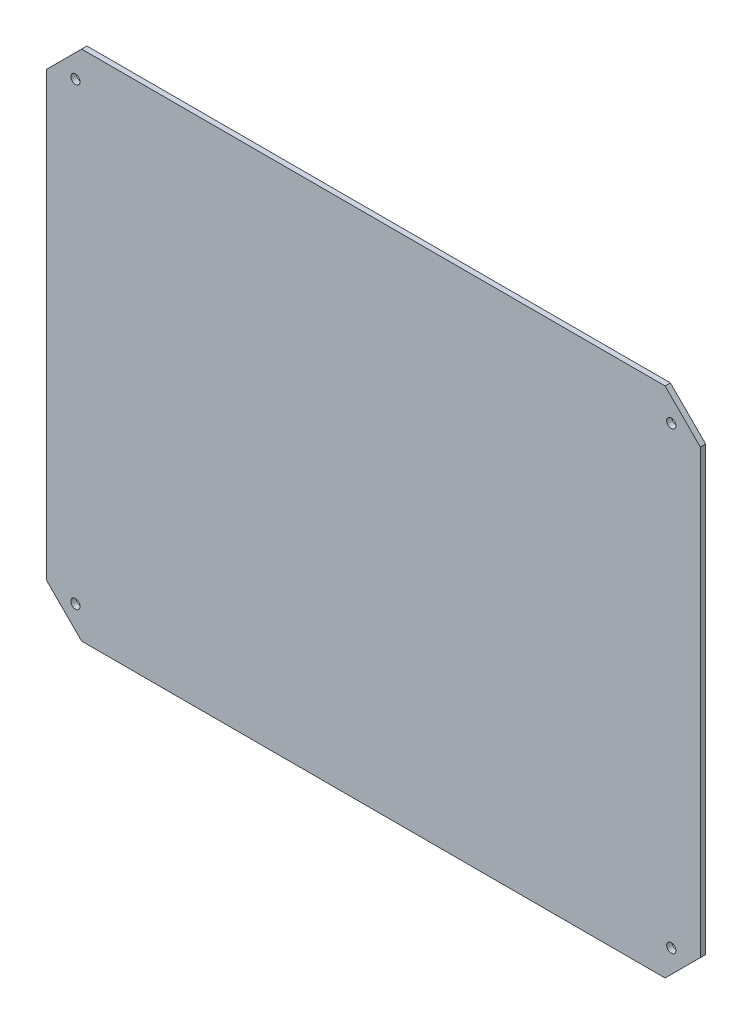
from build123d import *

# Parameters (mm, degrees)
SKETCH1_W           = 370
SKETCH1_H           = 290
BOSS_EXTRUDE1_DEPTH = 3
CHAMFER1_SIZE       = 20
SKETCH2_R           = 2.6
CUT_EXTRUDE1_DEPTH  = 471.115943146


with BuildPart() as part:
    # Sketch1 → Boss-Extrude1 (new body)
    with BuildSketch(Plane.XY):
        with Locations((185, 145)):
            Rectangle(SKETCH1_W, SKETCH1_H)
    extrude(amount=BOSS_EXTRUDE1_DEPTH)

    # Chamfer1
    chamfer1_edges = [part.edges().sort_by_distance(p)[0] for p in [
        (0, 290, 1.5),
        (370, 290, 1.5),
        (370, 0, 1.5),
        (0, 0, 1.5),
    ]]
    chamfer(chamfer1_edges, length=CHAMFER1_SIZE)

    # Sketch2 → Cut-Extrude1 (cut, through all)
    with BuildSketch(Plane.XY.offset(3)):
        with Locations((16.498311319, 16.498311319)):
            Circle(SKETCH2_R)
        with Locations((353.501688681, 16.498311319)):
            Circle(SKETCH2_R)
        with Locations((353.501688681, 273.501688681)):
            Circle(SKETCH2_R)
        with Locations((16.498311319, 273.501688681)):
            Circle(SKETCH2_R)
    extrude(amount=-CUT_EXTRUDE1_DEPTH, mode=Mode.SUBTRACT)


solid = part.part
